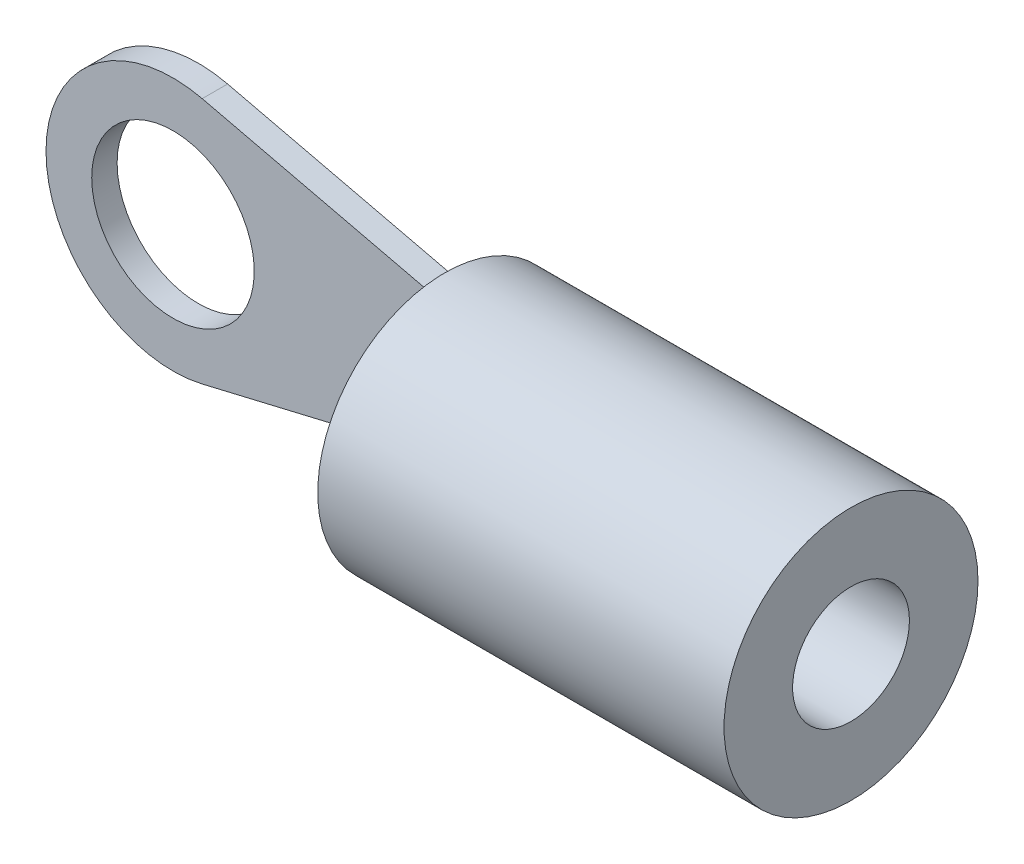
ISO-10303-21;
HEADER;
FILE_DESCRIPTION(('STEP AP214'),'2;1');
FILE_NAME('part.step','',(''),(''),'','','');
FILE_SCHEMA(('AUTOMOTIVE_DESIGN { 1 0 10303 214 1 1 1 1 }'));
ENDSEC;
DATA;
#1=APPLICATION_CONTEXT('core data for automotive mechanical design processes');
#2=APPLICATION_PROTOCOL_DEFINITION('international standard','automotive_design',2000,#1);
#3=PRODUCT_CONTEXT('',#1,'mechanical');
#4=PRODUCT('Part','Part','',(#3));
#5=PRODUCT_RELATED_PRODUCT_CATEGORY('part','',(#4));
#6=PRODUCT_DEFINITION_FORMATION('','',#4);
#7=PRODUCT_DEFINITION_CONTEXT('part definition',#1,'design');
#8=PRODUCT_DEFINITION('design','',#6,#7);
#9=PRODUCT_DEFINITION_SHAPE('','',#8);
#10=(LENGTH_UNIT() NAMED_UNIT(*) SI_UNIT(.MILLI.,.METRE.));
#11=(NAMED_UNIT(*) PLANE_ANGLE_UNIT() SI_UNIT($,.RADIAN.));
#12=(NAMED_UNIT(*) SI_UNIT($,.STERADIAN.) SOLID_ANGLE_UNIT());
#13=UNCERTAINTY_MEASURE_WITH_UNIT(LENGTH_MEASURE(1.E-05),#10,'distance_accuracy_value','');
#14=(GEOMETRIC_REPRESENTATION_CONTEXT(3) GLOBAL_UNCERTAINTY_ASSIGNED_CONTEXT((#13)) GLOBAL_UNIT_ASSIGNED_CONTEXT((#10,
#11,#12)) REPRESENTATION_CONTEXT('',''));
#15=CARTESIAN_POINT('',(0.,0.,0.));
#16=DIRECTION('',(0.,0.,1.));
#17=DIRECTION('',(1.,0.,0.));
#18=AXIS2_PLACEMENT_3D('',#15,#16,#17);
#19=CARTESIAN_POINT('',(0.,0.,0.));
#20=DIRECTION('',(0.,0.,1.));
#21=DIRECTION('',(1.,0.,0.));
#22=AXIS2_PLACEMENT_3D('',#19,#20,#21);
#23=PLANE('',#22);
#24=CARTESIAN_POINT('',(0.,0.,0.));
#25=DIRECTION('',(0.,0.,-1.));
#26=DIRECTION('',(-1.,0.,0.));
#27=AXIS2_PLACEMENT_3D('',#24,#25,#26);
#28=CIRCLE('',#27,1.6);
#29=CARTESIAN_POINT('',(-1.6,0.,0.));
#30=VERTEX_POINT('',#29);
#31=EDGE_CURVE('P0_E109',#30,#30,#28,.F.);
#32=ORIENTED_EDGE('',*,*,#31,.T.);
#33=EDGE_LOOP('',(#32));
#34=FACE_BOUND('',#33,.T.);
#35=CARTESIAN_POINT('',(0.,0.,0.));
#36=DIRECTION('',(0.,0.,-1.));
#37=DIRECTION('',(-1.,0.,0.));
#38=AXIS2_PLACEMENT_3D('',#35,#36,#37);
#39=CIRCLE('',#38,2.50000000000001);
#40=CARTESIAN_POINT('',(0.575362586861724,2.43289085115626,0.));
#41=VERTEX_POINT('',#40);
#42=CARTESIAN_POINT('',(0.575362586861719,-2.43289085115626,0.));
#43=VERTEX_POINT('',#42);
#44=EDGE_CURVE('P0_E20',#41,#43,#39,.F.);
#45=ORIENTED_EDGE('',*,*,#44,.F.);
#46=DIRECTION('',(0.9731563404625,-0.230145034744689,0.));
#47=VECTOR('',#46,1.);
#48=CARTESIAN_POINT('',(6.,1.14999999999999,0.));
#49=LINE('',#48,#47);
#50=CARTESIAN_POINT('',(6.,1.14999999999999,0.));
#51=VERTEX_POINT('',#50);
#52=EDGE_CURVE('P0_E79',#41,#51,#49,.T.);
#53=ORIENTED_EDGE('',*,*,#52,.T.);
#54=DIRECTION('',(0.,1.,0.));
#55=VECTOR('',#54,1.);
#56=CARTESIAN_POINT('',(6.,0.,0.));
#57=LINE('',#56,#55);
#58=CARTESIAN_POINT('',(6.,0.,0.));
#59=VERTEX_POINT('',#58);
#60=EDGE_CURVE('P0_E65',#59,#51,#57,.T.);
#61=ORIENTED_EDGE('',*,*,#60,.F.);
#62=DIRECTION('',(0.,1.,0.));
#63=VECTOR('',#62,1.);
#64=CARTESIAN_POINT('',(6.,0.,0.));
#65=LINE('',#64,#63);
#66=CARTESIAN_POINT('',(6.,-1.15,0.));
#67=VERTEX_POINT('',#66);
#68=EDGE_CURVE('P0_E132',#67,#59,#65,.T.);
#69=ORIENTED_EDGE('',*,*,#68,.F.);
#70=DIRECTION('',(-0.973156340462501,-0.230145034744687,0.));
#71=VECTOR('',#70,1.);
#72=CARTESIAN_POINT('',(0.575362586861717,-2.43289085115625,0.));
#73=LINE('',#72,#71);
#74=EDGE_CURVE('P0_E80',#67,#43,#73,.T.);
#75=ORIENTED_EDGE('',*,*,#74,.T.);
#76=EDGE_LOOP('',(#45,#53,#61,#69,#75));
#77=FACE_BOUND('',#76,.T.);
#78=ADVANCED_FACE('P0_F17',(#34,#77),#23,.F.);
#79=CARTESIAN_POINT('',(0.575362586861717,-2.43289085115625,0.5));
#80=DIRECTION('',(-0.230145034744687,0.973156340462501,0.));
#81=DIRECTION('',(-0.973156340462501,-0.230145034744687,0.));
#82=AXIS2_PLACEMENT_3D('',#79,#80,#81);
#83=PLANE('',#82);
#84=DIRECTION('',(0.,0.,1.));
#85=VECTOR('',#84,1.);
#86=CARTESIAN_POINT('',(6.,-1.15,0.5));
#87=LINE('',#86,#85);
#88=CARTESIAN_POINT('',(6.,-1.15,0.5));
#89=VERTEX_POINT('',#88);
#90=EDGE_CURVE('P0_E121',#89,#67,#87,.F.);
#91=ORIENTED_EDGE('',*,*,#90,.F.);
#92=DIRECTION('',(0.973156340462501,0.230145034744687,0.));
#93=VECTOR('',#92,1.);
#94=CARTESIAN_POINT('',(0.575362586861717,-2.43289085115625,0.5));
#95=LINE('',#94,#93);
#96=CARTESIAN_POINT('',(0.575362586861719,-2.43289085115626,0.5));
#97=VERTEX_POINT('',#96);
#98=EDGE_CURVE('P0_E107',#97,#89,#95,.T.);
#99=ORIENTED_EDGE('',*,*,#98,.F.);
#100=DIRECTION('',(0.,0.,-1.));
#101=VECTOR('',#100,1.);
#102=CARTESIAN_POINT('',(0.57536258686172,-2.43289085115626,0.5));
#103=LINE('',#102,#101);
#104=EDGE_CURVE('P0_E115',#43,#97,#103,.F.);
#105=ORIENTED_EDGE('',*,*,#104,.F.);
#106=ORIENTED_EDGE('',*,*,#74,.F.);
#107=EDGE_LOOP('',(#91,#99,#105,#106));
#108=FACE_BOUND('',#107,.T.);
#109=ADVANCED_FACE('P0_F234',(#108),#83,.F.);
#110=CARTESIAN_POINT('',(6.,1.14999999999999,0.5));
#111=DIRECTION('',(-0.230145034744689,-0.9731563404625,0.));
#112=DIRECTION('',(0.9731563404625,-0.230145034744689,0.));
#113=AXIS2_PLACEMENT_3D('',#110,#111,#112);
#114=PLANE('',#113);
#115=DIRECTION('',(0.,0.,-1.));
#116=VECTOR('',#115,1.);
#117=CARTESIAN_POINT('',(0.575362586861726,2.43289085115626,0.5));
#118=LINE('',#117,#116);
#119=CARTESIAN_POINT('',(0.575362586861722,2.43289085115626,0.5));
#120=VERTEX_POINT('',#119);
#121=EDGE_CURVE('P0_E86',#120,#41,#118,.T.);
#122=ORIENTED_EDGE('',*,*,#121,.F.);
#123=DIRECTION('',(-0.973156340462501,0.230145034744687,0.));
#124=VECTOR('',#123,1.);
#125=CARTESIAN_POINT('',(6.,1.15,0.5));
#126=LINE('',#125,#124);
#127=CARTESIAN_POINT('',(6.,1.15,0.5));
#128=VERTEX_POINT('',#127);
#129=EDGE_CURVE('P0_E83',#128,#120,#126,.T.);
#130=ORIENTED_EDGE('',*,*,#129,.F.);
#131=DIRECTION('',(0.,0.,1.));
#132=VECTOR('',#131,1.);
#133=CARTESIAN_POINT('',(6.,1.14999999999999,0.5));
#134=LINE('',#133,#132);
#135=EDGE_CURVE('P0_E72',#51,#128,#134,.T.);
#136=ORIENTED_EDGE('',*,*,#135,.F.);
#137=ORIENTED_EDGE('',*,*,#52,.F.);
#138=EDGE_LOOP('',(#122,#130,#136,#137));
#139=FACE_BOUND('',#138,.T.);
#140=ADVANCED_FACE('P0_F84',(#139),#114,.F.);
#141=CARTESIAN_POINT('',(0.,0.,0.5));
#142=DIRECTION('',(0.,0.,-1.));
#143=DIRECTION('',(-1.,0.,0.));
#144=AXIS2_PLACEMENT_3D('',#141,#142,#143);
#145=CYLINDRICAL_SURFACE('',#144,2.50000000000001);
#146=CARTESIAN_POINT('',(0.,0.,0.5));
#147=DIRECTION('',(0.,0.,-1.));
#148=DIRECTION('',(-1.,0.,0.));
#149=AXIS2_PLACEMENT_3D('',#146,#147,#148);
#150=CIRCLE('',#149,2.50000000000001);
#151=EDGE_CURVE('P0_E89',#120,#97,#150,.F.);
#152=ORIENTED_EDGE('',*,*,#151,.F.);
#153=ORIENTED_EDGE('',*,*,#121,.T.);
#154=ORIENTED_EDGE('',*,*,#44,.T.);
#155=ORIENTED_EDGE('',*,*,#104,.T.);
#156=EDGE_LOOP('',(#152,#153,#154,#155));
#157=FACE_BOUND('',#156,.T.);
#158=ADVANCED_FACE('P0_F156',(#157),#145,.T.);
#159=CARTESIAN_POINT('',(0.,0.,0.5));
#160=DIRECTION('',(0.,0.,-1.));
#161=DIRECTION('',(-1.,0.,0.));
#162=AXIS2_PLACEMENT_3D('',#159,#160,#161);
#163=CYLINDRICAL_SURFACE('',#162,1.6);
#164=ORIENTED_EDGE('',*,*,#31,.F.);
#165=EDGE_LOOP('',(#164));
#166=FACE_BOUND('',#165,.T.);
#167=CARTESIAN_POINT('',(0.,0.,0.5));
#168=DIRECTION('',(0.,0.,-1.));
#169=DIRECTION('',(-1.,0.,0.));
#170=AXIS2_PLACEMENT_3D('',#167,#168,#169);
#171=CIRCLE('',#170,1.6);
#172=CARTESIAN_POINT('',(-1.6,0.,0.5));
#173=VERTEX_POINT('',#172);
#174=EDGE_CURVE('P0_E99',#173,#173,#171,.T.);
#175=ORIENTED_EDGE('',*,*,#174,.F.);
#176=EDGE_LOOP('',(#175));
#177=FACE_BOUND('',#176,.T.);
#178=ADVANCED_FACE('P0_F152',(#166,#177),#163,.F.);
#179=CARTESIAN_POINT('',(6.,0.,1.15));
#180=DIRECTION('',(1.,0.,0.));
#181=DIRECTION('',(0.,0.,-1.));
#182=AXIS2_PLACEMENT_3D('',#179,#180,#181);
#183=CYLINDRICAL_SURFACE('',#182,0.5);
#184=CARTESIAN_POINT('',(6.,0.,1.15));
#185=DIRECTION('',(1.,0.,0.));
#186=DIRECTION('',(0.,0.,-1.));
#187=AXIS2_PLACEMENT_3D('',#184,#185,#186);
#188=CIRCLE('',#187,0.5);
#189=CARTESIAN_POINT('',(6.,0.,0.65));
#190=VERTEX_POINT('',#189);
#191=EDGE_CURVE('P0_E93',#190,#190,#188,.T.);
#192=ORIENTED_EDGE('',*,*,#191,.F.);
#193=EDGE_LOOP('',(#192));
#194=FACE_BOUND('',#193,.T.);
#195=CARTESIAN_POINT('',(10.,0.,1.15));
#196=DIRECTION('',(1.,0.,0.));
#197=DIRECTION('',(0.,0.,-1.));
#198=AXIS2_PLACEMENT_3D('',#195,#196,#197);
#199=CIRCLE('',#198,0.5);
#200=CARTESIAN_POINT('',(10.,0.,0.65));
#201=VERTEX_POINT('',#200);
#202=EDGE_CURVE('P0_E94',#201,#201,#199,.F.);
#203=ORIENTED_EDGE('',*,*,#202,.F.);
#204=EDGE_LOOP('',(#203));
#205=FACE_BOUND('',#204,.T.);
#206=ADVANCED_FACE('P0_F155',(#194,#205),#183,.F.);
#207=CARTESIAN_POINT('',(0.,0.,0.5));
#208=DIRECTION('',(0.,0.,1.));
#209=DIRECTION('',(1.,0.,0.));
#210=AXIS2_PLACEMENT_3D('',#207,#208,#209);
#211=PLANE('',#210);
#212=ORIENTED_EDGE('',*,*,#174,.T.);
#213=EDGE_LOOP('',(#212));
#214=FACE_BOUND('',#213,.T.);
#215=ORIENTED_EDGE('',*,*,#129,.T.);
#216=ORIENTED_EDGE('',*,*,#151,.T.);
#217=ORIENTED_EDGE('',*,*,#98,.T.);
#218=DIRECTION('',(0.,1.,0.));
#219=VECTOR('',#218,1.);
#220=CARTESIAN_POINT('',(6.,0.,0.5));
#221=LINE('',#220,#219);
#222=CARTESIAN_POINT('',(6.,-0.948683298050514,0.5));
#223=VERTEX_POINT('',#222);
#224=EDGE_CURVE('P0_E35',#89,#223,#221,.T.);
#225=ORIENTED_EDGE('',*,*,#224,.T.);
#226=DIRECTION('',(0.,1.,0.));
#227=VECTOR('',#226,1.);
#228=CARTESIAN_POINT('',(6.,0.,0.5));
#229=LINE('',#228,#227);
#230=CARTESIAN_POINT('',(6.,0.948683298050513,0.5));
#231=VERTEX_POINT('',#230);
#232=EDGE_CURVE('P0_E92',#231,#223,#229,.F.);
#233=ORIENTED_EDGE('',*,*,#232,.F.);
#234=DIRECTION('',(0.,-1.,0.));
#235=VECTOR('',#234,1.);
#236=CARTESIAN_POINT('',(6.,-1.15,0.5));
#237=LINE('',#236,#235);
#238=EDGE_CURVE('P0_E76',#231,#128,#237,.F.);
#239=ORIENTED_EDGE('',*,*,#238,.T.);
#240=EDGE_LOOP('',(#215,#216,#217,#225,#233,#239));
#241=FACE_BOUND('',#240,.T.);
#242=ADVANCED_FACE('P0_F91',(#214,#241),#211,.T.);
#243=CARTESIAN_POINT('',(10.,0.,1.15));
#244=DIRECTION('',(1.,0.,0.));
#245=DIRECTION('',(0.,0.,-1.));
#246=AXIS2_PLACEMENT_3D('',#243,#244,#245);
#247=PLANE('',#246);
#248=CARTESIAN_POINT('',(10.,0.,1.15));
#249=DIRECTION('',(1.,0.,0.));
#250=DIRECTION('',(0.,0.,-1.));
#251=AXIS2_PLACEMENT_3D('',#248,#249,#250);
#252=CIRCLE('',#251,1.15);
#253=CARTESIAN_POINT('',(10.,0.,0.));
#254=VERTEX_POINT('',#253);
#255=EDGE_CURVE('P0_E143',#254,#254,#252,.F.);
#256=ORIENTED_EDGE('',*,*,#255,.F.);
#257=EDGE_LOOP('',(#256));
#258=FACE_BOUND('',#257,.T.);
#259=ORIENTED_EDGE('',*,*,#202,.T.);
#260=EDGE_LOOP('',(#259));
#261=FACE_BOUND('',#260,.T.);
#262=ADVANCED_FACE('P0_F161',(#258,#261),#247,.T.);
#263=CARTESIAN_POINT('',(6.,-1.15,0.5));
#264=DIRECTION('',(-1.,0.,0.));
#265=DIRECTION('',(0.,-1.,0.));
#266=AXIS2_PLACEMENT_3D('',#263,#264,#265);
#267=PLANE('',#266);
#268=ORIENTED_EDGE('',*,*,#60,.T.);
#269=ORIENTED_EDGE('',*,*,#135,.T.);
#270=ORIENTED_EDGE('',*,*,#238,.F.);
#271=CARTESIAN_POINT('',(6.,0.,1.15));
#272=DIRECTION('',(1.,0.,0.));
#273=DIRECTION('',(0.,0.,-1.));
#274=AXIS2_PLACEMENT_3D('',#271,#272,#273);
#275=CIRCLE('',#274,1.15);
#276=EDGE_CURVE('P0_E140',#59,#231,#275,.T.);
#277=ORIENTED_EDGE('',*,*,#276,.F.);
#278=EDGE_LOOP('',(#268,#269,#270,#277));
#279=FACE_BOUND('',#278,.T.);
#280=ADVANCED_FACE('P0_F74',(#279),#267,.F.);
#281=CARTESIAN_POINT('',(6.,0.,1.15));
#282=DIRECTION('',(-1.,0.,0.));
#283=DIRECTION('',(0.,0.,1.));
#284=AXIS2_PLACEMENT_3D('',#281,#282,#283);
#285=PLANE('',#284);
#286=ORIENTED_EDGE('',*,*,#232,.T.);
#287=CARTESIAN_POINT('',(6.,0.,1.15));
#288=DIRECTION('',(1.,0.,0.));
#289=DIRECTION('',(0.,0.,-1.));
#290=AXIS2_PLACEMENT_3D('',#287,#288,#289);
#291=CIRCLE('',#290,1.15);
#292=EDGE_CURVE('P0_E26',#231,#223,#291,.T.);
#293=ORIENTED_EDGE('',*,*,#292,.F.);
#294=EDGE_LOOP('',(#286,#293));
#295=FACE_BOUND('',#294,.T.);
#296=ORIENTED_EDGE('',*,*,#191,.T.);
#297=EDGE_LOOP('',(#296));
#298=FACE_BOUND('',#297,.T.);
#299=ADVANCED_FACE('P0_F180',(#295,#298),#285,.T.);
#300=CARTESIAN_POINT('',(6.,-1.15,0.5));
#301=DIRECTION('',(-1.,0.,0.));
#302=DIRECTION('',(0.,-1.,0.));
#303=AXIS2_PLACEMENT_3D('',#300,#301,#302);
#304=PLANE('',#303);
#305=ORIENTED_EDGE('',*,*,#224,.F.);
#306=ORIENTED_EDGE('',*,*,#90,.T.);
#307=ORIENTED_EDGE('',*,*,#68,.T.);
#308=CARTESIAN_POINT('',(6.,0.,1.15));
#309=DIRECTION('',(1.,0.,0.));
#310=DIRECTION('',(0.,0.,-1.));
#311=AXIS2_PLACEMENT_3D('',#308,#309,#310);
#312=CIRCLE('',#311,1.15);
#313=EDGE_CURVE('P0_E11',#223,#59,#312,.T.);
#314=ORIENTED_EDGE('',*,*,#313,.F.);
#315=EDGE_LOOP('',(#305,#306,#307,#314));
#316=FACE_BOUND('',#315,.T.);
#317=ADVANCED_FACE('P0_F174',(#316),#304,.F.);
#318=CARTESIAN_POINT('',(6.,0.,1.15));
#319=DIRECTION('',(1.,0.,0.));
#320=DIRECTION('',(0.,0.,-1.));
#321=AXIS2_PLACEMENT_3D('',#318,#319,#320);
#322=CYLINDRICAL_SURFACE('',#321,1.15);
#323=ORIENTED_EDGE('',*,*,#292,.T.);
#324=ORIENTED_EDGE('',*,*,#313,.T.);
#325=ORIENTED_EDGE('',*,*,#276,.T.);
#326=EDGE_LOOP('',(#323,#324,#325));
#327=FACE_BOUND('',#326,.T.);
#328=ORIENTED_EDGE('',*,*,#255,.T.);
#329=EDGE_LOOP('',(#328));
#330=FACE_BOUND('',#329,.T.);
#331=ADVANCED_FACE('P0_F172',(#327,#330),#322,.T.);
#332=CLOSED_SHELL('',(#78,#109,#140,#158,#178,#206,#242,#262,#280,#299,#317,#331));
#333=MANIFOLD_SOLID_BREP('P0_B1',#332);
#334=CARTESIAN_POINT('',(6.,0.,1.15));
#335=DIRECTION('',(1.,0.,0.));
#336=DIRECTION('',(0.,0.,-1.));
#337=AXIS2_PLACEMENT_3D('',#334,#335,#336);
#338=CYLINDRICAL_SURFACE('',#337,1.15);
#339=CARTESIAN_POINT('',(6.,0.,1.15));
#340=DIRECTION('',(1.,0.,0.));
#341=DIRECTION('',(0.,0.,-1.));
#342=AXIS2_PLACEMENT_3D('',#339,#340,#341);
#343=CIRCLE('',#342,1.15);
#344=CARTESIAN_POINT('',(6.,0.,0.));
#345=VERTEX_POINT('',#344);
#346=EDGE_CURVE('P1_E27',#345,#345,#343,.T.);
#347=ORIENTED_EDGE('',*,*,#346,.F.);
#348=EDGE_LOOP('',(#347));
#349=FACE_BOUND('',#348,.T.);
#350=CARTESIAN_POINT('',(14.,0.,1.15));
#351=DIRECTION('',(1.,0.,0.));
#352=DIRECTION('',(0.,0.,-1.));
#353=AXIS2_PLACEMENT_3D('',#350,#351,#352);
#354=CIRCLE('',#353,1.15);
#355=CARTESIAN_POINT('',(14.,0.,0.));
#356=VERTEX_POINT('',#355);
#357=EDGE_CURVE('P1_E18',#356,#356,#354,.F.);
#358=ORIENTED_EDGE('',*,*,#357,.F.);
#359=EDGE_LOOP('',(#358));
#360=FACE_BOUND('',#359,.T.);
#361=ADVANCED_FACE('P1_F15',(#349,#360),#338,.F.);
#362=CARTESIAN_POINT('',(14.,0.,1.15));
#363=DIRECTION('',(1.,0.,0.));
#364=DIRECTION('',(0.,0.,-1.));
#365=AXIS2_PLACEMENT_3D('',#362,#363,#364);
#366=PLANE('',#365);
#367=CARTESIAN_POINT('',(14.,0.,1.15));
#368=DIRECTION('',(1.,0.,0.));
#369=DIRECTION('',(0.,0.,-1.));
#370=AXIS2_PLACEMENT_3D('',#367,#368,#369);
#371=CIRCLE('',#370,2.5);
#372=CARTESIAN_POINT('',(14.,0.,-1.35));
#373=VERTEX_POINT('',#372);
#374=EDGE_CURVE('P1_E22',#373,#373,#371,.F.);
#375=ORIENTED_EDGE('',*,*,#374,.F.);
#376=EDGE_LOOP('',(#375));
#377=FACE_BOUND('',#376,.T.);
#378=ORIENTED_EDGE('',*,*,#357,.T.);
#379=EDGE_LOOP('',(#378));
#380=FACE_BOUND('',#379,.T.);
#381=ADVANCED_FACE('P1_F35',(#377,#380),#366,.T.);
#382=CARTESIAN_POINT('',(6.,0.,1.15));
#383=DIRECTION('',(-1.,0.,0.));
#384=DIRECTION('',(0.,0.,1.));
#385=AXIS2_PLACEMENT_3D('',#382,#383,#384);
#386=PLANE('',#385);
#387=CARTESIAN_POINT('',(6.,0.,1.15));
#388=DIRECTION('',(1.,0.,0.));
#389=DIRECTION('',(0.,0.,-1.));
#390=AXIS2_PLACEMENT_3D('',#387,#388,#389);
#391=CIRCLE('',#390,2.5);
#392=CARTESIAN_POINT('',(6.,0.,-1.35));
#393=VERTEX_POINT('',#392);
#394=EDGE_CURVE('P1_E10',#393,#393,#391,.T.);
#395=ORIENTED_EDGE('',*,*,#394,.F.);
#396=EDGE_LOOP('',(#395));
#397=FACE_BOUND('',#396,.T.);
#398=ORIENTED_EDGE('',*,*,#346,.T.);
#399=EDGE_LOOP('',(#398));
#400=FACE_BOUND('',#399,.T.);
#401=ADVANCED_FACE('P1_F43',(#397,#400),#386,.T.);
#402=CARTESIAN_POINT('',(6.,0.,1.15));
#403=DIRECTION('',(1.,0.,0.));
#404=DIRECTION('',(0.,0.,-1.));
#405=AXIS2_PLACEMENT_3D('',#402,#403,#404);
#406=CYLINDRICAL_SURFACE('',#405,2.5);
#407=ORIENTED_EDGE('',*,*,#394,.T.);
#408=EDGE_LOOP('',(#407));
#409=FACE_BOUND('',#408,.T.);
#410=ORIENTED_EDGE('',*,*,#374,.T.);
#411=EDGE_LOOP('',(#410));
#412=FACE_BOUND('',#411,.T.);
#413=ADVANCED_FACE('P1_F45',(#409,#412),#406,.T.);
#414=CLOSED_SHELL('',(#361,#381,#401,#413));
#415=MANIFOLD_SOLID_BREP('P1_B1',#414);
#416=ADVANCED_BREP_SHAPE_REPRESENTATION('',(#18,#333,#415),#14);
#417=SHAPE_DEFINITION_REPRESENTATION(#9,#416);
ENDSEC;
END-ISO-10303-21;
